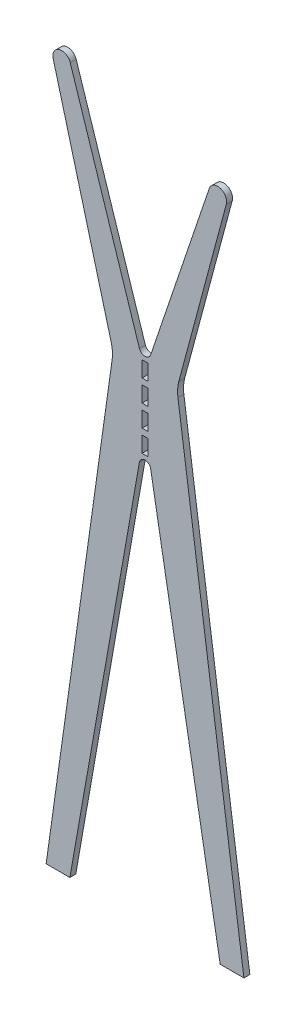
ISO-10303-21;
HEADER;
FILE_DESCRIPTION(('STEP AP214'),'2;1');
FILE_NAME('part.step','',(''),(''),'','','');
FILE_SCHEMA(('AUTOMOTIVE_DESIGN { 1 0 10303 214 1 1 1 1 }'));
ENDSEC;
DATA;
#1=APPLICATION_CONTEXT('core data for automotive mechanical design processes');
#2=APPLICATION_PROTOCOL_DEFINITION('international standard','automotive_design',2000,#1);
#3=PRODUCT_CONTEXT('',#1,'mechanical');
#4=PRODUCT('Part','Part','',(#3));
#5=PRODUCT_RELATED_PRODUCT_CATEGORY('part','',(#4));
#6=PRODUCT_DEFINITION_FORMATION('','',#4);
#7=PRODUCT_DEFINITION_CONTEXT('part definition',#1,'design');
#8=PRODUCT_DEFINITION('design','',#6,#7);
#9=PRODUCT_DEFINITION_SHAPE('','',#8);
#10=(LENGTH_UNIT() NAMED_UNIT(*) SI_UNIT(.MILLI.,.METRE.));
#11=(NAMED_UNIT(*) PLANE_ANGLE_UNIT() SI_UNIT($,.RADIAN.));
#12=(NAMED_UNIT(*) SI_UNIT($,.STERADIAN.) SOLID_ANGLE_UNIT());
#13=UNCERTAINTY_MEASURE_WITH_UNIT(LENGTH_MEASURE(1.E-05),#10,'distance_accuracy_value','');
#14=(GEOMETRIC_REPRESENTATION_CONTEXT(3) GLOBAL_UNCERTAINTY_ASSIGNED_CONTEXT((#13)) GLOBAL_UNIT_ASSIGNED_CONTEXT((#10,
#11,#12)) REPRESENTATION_CONTEXT('',''));
#15=CARTESIAN_POINT('',(0.,0.,0.));
#16=DIRECTION('',(0.,0.,1.));
#17=DIRECTION('',(1.,0.,0.));
#18=AXIS2_PLACEMENT_3D('',#15,#16,#17);
#19=CARTESIAN_POINT('',(172.23547988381,299.999999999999,7.5));
#20=DIRECTION('',(0.,0.,-1.));
#21=DIRECTION('',(-1.,0.,0.));
#22=AXIS2_PLACEMENT_3D('',#19,#20,#21);
#23=PLANE('',#22);
#24=DIRECTION('',(0.,1.,0.));
#25=VECTOR('',#24,1.);
#26=CARTESIAN_POINT('',(7.49999999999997,214.94837345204,7.5));
#27=LINE('',#26,#25);
#28=CARTESIAN_POINT('',(7.49999999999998,174.94837345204,7.5));
#29=VERTEX_POINT('',#28);
#30=CARTESIAN_POINT('',(7.49999999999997,214.94837345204,7.5));
#31=VERTEX_POINT('',#30);
#32=EDGE_CURVE('E300',#29,#31,#27,.T.);
#33=ORIENTED_EDGE('',*,*,#32,.F.);
#34=DIRECTION('',(1.,0.,0.));
#35=VECTOR('',#34,1.);
#36=CARTESIAN_POINT('',(-7.50000000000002,174.94837345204,7.5));
#37=LINE('',#36,#35);
#38=CARTESIAN_POINT('',(-7.50000000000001,174.94837345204,7.5));
#39=VERTEX_POINT('',#38);
#40=EDGE_CURVE('E311',#39,#29,#37,.T.);
#41=ORIENTED_EDGE('',*,*,#40,.F.);
#42=DIRECTION('',(0.,-1.,0.));
#43=VECTOR('',#42,1.);
#44=CARTESIAN_POINT('',(-7.50000000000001,214.94837345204,7.5));
#45=LINE('',#44,#43);
#46=CARTESIAN_POINT('',(-7.50000000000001,214.94837345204,7.5));
#47=VERTEX_POINT('',#46);
#48=EDGE_CURVE('E307',#47,#39,#45,.T.);
#49=ORIENTED_EDGE('',*,*,#48,.F.);
#50=DIRECTION('',(-1.,0.,0.));
#51=VECTOR('',#50,1.);
#52=CARTESIAN_POINT('',(-7.50000000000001,214.94837345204,7.5));
#53=LINE('',#52,#51);
#54=EDGE_CURVE('E303',#31,#47,#53,.T.);
#55=ORIENTED_EDGE('',*,*,#54,.F.);
#56=EDGE_LOOP('',(#33,#41,#49,#55));
#57=FACE_BOUND('',#56,.T.);
#58=DIRECTION('',(0.,1.,0.));
#59=VECTOR('',#58,1.);
#60=CARTESIAN_POINT('',(7.49999999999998,269.94837345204,7.5));
#61=LINE('',#60,#59);
#62=CARTESIAN_POINT('',(7.49999999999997,229.94837345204,7.5));
#63=VERTEX_POINT('',#62);
#64=CARTESIAN_POINT('',(7.49999999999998,269.94837345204,7.5));
#65=VERTEX_POINT('',#64);
#66=EDGE_CURVE('E386',#63,#65,#61,.T.);
#67=ORIENTED_EDGE('',*,*,#66,.F.);
#68=DIRECTION('',(1.,0.,0.));
#69=VECTOR('',#68,1.);
#70=CARTESIAN_POINT('',(-7.50000000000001,229.94837345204,7.5));
#71=LINE('',#70,#69);
#72=CARTESIAN_POINT('',(-7.50000000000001,229.94837345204,7.5));
#73=VERTEX_POINT('',#72);
#74=EDGE_CURVE('E397',#73,#63,#71,.T.);
#75=ORIENTED_EDGE('',*,*,#74,.F.);
#76=DIRECTION('',(0.,-1.,0.));
#77=VECTOR('',#76,1.);
#78=CARTESIAN_POINT('',(-7.50000000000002,269.94837345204,7.5));
#79=LINE('',#78,#77);
#80=CARTESIAN_POINT('',(-7.50000000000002,269.94837345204,7.5));
#81=VERTEX_POINT('',#80);
#82=EDGE_CURVE('E393',#81,#73,#79,.T.);
#83=ORIENTED_EDGE('',*,*,#82,.F.);
#84=DIRECTION('',(-1.,0.,0.));
#85=VECTOR('',#84,1.);
#86=CARTESIAN_POINT('',(-7.50000000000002,269.94837345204,7.5));
#87=LINE('',#86,#85);
#88=EDGE_CURVE('E389',#65,#81,#87,.T.);
#89=ORIENTED_EDGE('',*,*,#88,.F.);
#90=EDGE_LOOP('',(#67,#75,#83,#89));
#91=FACE_BOUND('',#90,.T.);
#92=DIRECTION('',(-0.139173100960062,0.990268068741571,0.));
#93=VECTOR('',#92,1.);
#94=CARTESIAN_POINT('',(250.,-900.,7.5));
#95=LINE('',#94,#93);
#96=CARTESIAN_POINT('',(250.,-900.,7.5));
#97=VERTEX_POINT('',#96);
#98=CARTESIAN_POINT('',(83.1113536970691,287.474420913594,7.5));
#99=VERTEX_POINT('',#98);
#100=EDGE_CURVE('E429',#97,#99,#95,.T.);
#101=ORIENTED_EDGE('',*,*,#100,.T.);
#102=CARTESIAN_POINT('',(172.23547988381,299.999999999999,7.5));
#103=DIRECTION('',(0.,0.,-1.));
#104=DIRECTION('',(-1.,0.,0.));
#105=AXIS2_PLACEMENT_3D('',#102,#103,#104);
#106=CIRCLE('',#105,90.);
#107=CARTESIAN_POINT('',(85.3021555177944,323.293714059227,7.5));
#108=VERTEX_POINT('',#107);
#109=EDGE_CURVE('E433',#99,#108,#106,.T.);
#110=ORIENTED_EDGE('',*,*,#109,.T.);
#111=DIRECTION('',(0.258819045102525,0.965925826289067,0.));
#112=VECTOR('',#111,1.);
#113=CARTESIAN_POINT('',(85.3021555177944,323.293714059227,7.5));
#114=LINE('',#113,#112);
#115=CARTESIAN_POINT('',(205.442086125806,771.662039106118,7.5));
#116=VERTEX_POINT('',#115);
#117=EDGE_CURVE('E437',#108,#116,#114,.T.);
#118=ORIENTED_EDGE('',*,*,#117,.T.);
#119=CARTESIAN_POINT('',(183.697603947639,777.488455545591,7.5));
#120=DIRECTION('',(0.,0.,1.));
#121=DIRECTION('',(-1.,0.,0.));
#122=AXIS2_PLACEMENT_3D('',#119,#120,#121);
#123=CIRCLE('',#122,22.5115444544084);
#124=CARTESIAN_POINT('',(162.370665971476,784.69479652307,7.5));
#125=VERTEX_POINT('',#124);
#126=EDGE_CURVE('E440',#116,#125,#123,.T.);
#127=ORIENTED_EDGE('',*,*,#126,.T.);
#128=DIRECTION('',(-0.320117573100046,-0.947377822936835,0.));
#129=VECTOR('',#128,1.);
#130=CARTESIAN_POINT('',(14.2106673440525,346.219971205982,7.5));
#131=LINE('',#130,#129);
#132=CARTESIAN_POINT('',(14.2106673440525,346.219971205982,7.5));
#133=VERTEX_POINT('',#132);
#134=EDGE_CURVE('E443',#125,#133,#131,.T.);
#135=ORIENTED_EDGE('',*,*,#134,.T.);
#136=CARTESIAN_POINT('',(0.,351.021734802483,7.5));
#137=DIRECTION('',(0.,0.,-1.));
#138=DIRECTION('',(1.,0.,0.));
#139=AXIS2_PLACEMENT_3D('',#136,#137,#138);
#140=CIRCLE('',#139,15.);
#141=CARTESIAN_POINT('',(-14.2106673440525,346.219971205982,7.5));
#142=VERTEX_POINT('',#141);
#143=EDGE_CURVE('E446',#133,#142,#140,.T.);
#144=ORIENTED_EDGE('',*,*,#143,.T.);
#145=DIRECTION('',(-0.309016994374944,0.951056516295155,0.));
#146=VECTOR('',#145,1.);
#147=CARTESIAN_POINT('',(-189.091409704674,884.447552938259,7.5));
#148=LINE('',#147,#146);
#149=CARTESIAN_POINT('',(-189.091409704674,884.447552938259,7.5));
#150=VERTEX_POINT('',#149);
#151=EDGE_CURVE('E449',#142,#150,#148,.T.);
#152=ORIENTED_EDGE('',*,*,#151,.T.);
#153=CARTESIAN_POINT('',(-210.497516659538,877.492287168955,7.5));
#154=DIRECTION('',(0.,0.,1.));
#155=DIRECTION('',(-1.,0.,0.));
#156=AXIS2_PLACEMENT_3D('',#153,#154,#155);
#157=CIRCLE('',#156,22.5077128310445);
#158=CARTESIAN_POINT('',(-232.238297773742,871.666862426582,7.5));
#159=VERTEX_POINT('',#158);
#160=EDGE_CURVE('E452',#150,#159,#157,.T.);
#161=ORIENTED_EDGE('',*,*,#160,.T.);
#162=DIRECTION('',(0.258819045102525,-0.965925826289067,0.));
#163=VECTOR('',#162,1.);
#164=CARTESIAN_POINT('',(-85.3021555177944,323.293714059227,7.5));
#165=LINE('',#164,#163);
#166=CARTESIAN_POINT('',(-85.3021555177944,323.293714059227,7.5));
#167=VERTEX_POINT('',#166);
#168=EDGE_CURVE('E455',#159,#167,#165,.T.);
#169=ORIENTED_EDGE('',*,*,#168,.T.);
#170=CARTESIAN_POINT('',(-172.23547988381,299.999999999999,7.5));
#171=DIRECTION('',(0.,0.,-1.));
#172=DIRECTION('',(1.,0.,0.));
#173=AXIS2_PLACEMENT_3D('',#170,#171,#172);
#174=CIRCLE('',#173,90.);
#175=CARTESIAN_POINT('',(-83.1113536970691,287.474420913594,7.5));
#176=VERTEX_POINT('',#175);
#177=EDGE_CURVE('E458',#167,#176,#174,.T.);
#178=ORIENTED_EDGE('',*,*,#177,.T.);
#179=DIRECTION('',(-0.139173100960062,-0.990268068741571,0.));
#180=VECTOR('',#179,1.);
#181=CARTESIAN_POINT('',(-250.,-900.,7.5));
#182=LINE('',#181,#180);
#183=CARTESIAN_POINT('',(-250.,-900.,7.5));
#184=VERTEX_POINT('',#183);
#185=EDGE_CURVE('E461',#176,#184,#182,.T.);
#186=ORIENTED_EDGE('',*,*,#185,.T.);
#187=DIRECTION('',(1.,0.,0.));
#188=VECTOR('',#187,1.);
#189=CARTESIAN_POINT('',(-250.,-900.,7.5));
#190=LINE('',#189,#188);
#191=CARTESIAN_POINT('',(-190.,-900.,7.5));
#192=VERTEX_POINT('',#191);
#193=EDGE_CURVE('E464',#184,#192,#190,.T.);
#194=ORIENTED_EDGE('',*,*,#193,.T.);
#195=DIRECTION('',(0.173648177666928,0.984807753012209,0.));
#196=VECTOR('',#195,1.);
#197=CARTESIAN_POINT('',(-190.,-900.,7.5));
#198=LINE('',#197,#196);
#199=CARTESIAN_POINT('',(-14.2106673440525,96.9508463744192,7.5));
#200=VERTEX_POINT('',#199);
#201=EDGE_CURVE('E467',#192,#200,#198,.T.);
#202=ORIENTED_EDGE('',*,*,#201,.T.);
#203=CARTESIAN_POINT('',(0.,94.4451223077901,7.5));
#204=DIRECTION('',(0.,0.,-1.));
#205=DIRECTION('',(-1.,0.,0.));
#206=AXIS2_PLACEMENT_3D('',#203,#204,#205);
#207=CIRCLE('',#206,14.4298897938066);
#208=CARTESIAN_POINT('',(14.2106673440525,96.9508463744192,7.5));
#209=VERTEX_POINT('',#208);
#210=EDGE_CURVE('E470',#200,#209,#207,.T.);
#211=ORIENTED_EDGE('',*,*,#210,.T.);
#212=DIRECTION('',(0.173648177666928,-0.984807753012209,0.));
#213=VECTOR('',#212,1.);
#214=CARTESIAN_POINT('',(190.,-900.,7.5));
#215=LINE('',#214,#213);
#216=CARTESIAN_POINT('',(190.,-900.,7.5));
#217=VERTEX_POINT('',#216);
#218=EDGE_CURVE('E473',#209,#217,#215,.T.);
#219=ORIENTED_EDGE('',*,*,#218,.T.);
#220=DIRECTION('',(1.,0.,0.));
#221=VECTOR('',#220,1.);
#222=CARTESIAN_POINT('',(250.,-900.,7.5));
#223=LINE('',#222,#221);
#224=EDGE_CURVE('E476',#217,#97,#223,.T.);
#225=ORIENTED_EDGE('',*,*,#224,.T.);
#226=EDGE_LOOP('',(#101,#110,#118,#127,#135,#144,#152,#161,#169,#178,#186,#194,#202,#211,#219,#225));
#227=FACE_BOUND('',#226,.T.);
#228=DIRECTION('',(0.,1.,0.));
#229=VECTOR('',#228,1.);
#230=CARTESIAN_POINT('',(7.49999999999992,324.94837345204,7.5));
#231=LINE('',#230,#229);
#232=CARTESIAN_POINT('',(7.49999999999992,284.94837345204,7.5));
#233=VERTEX_POINT('',#232);
#234=CARTESIAN_POINT('',(7.49999999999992,324.94837345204,7.5));
#235=VERTEX_POINT('',#234);
#236=EDGE_CURVE('E343',#233,#235,#231,.T.);
#237=ORIENTED_EDGE('',*,*,#236,.F.);
#238=DIRECTION('',(1.,0.,0.));
#239=VECTOR('',#238,1.);
#240=CARTESIAN_POINT('',(-7.50000000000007,284.94837345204,7.5));
#241=LINE('',#240,#239);
#242=CARTESIAN_POINT('',(-7.50000000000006,284.94837345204,7.5));
#243=VERTEX_POINT('',#242);
#244=EDGE_CURVE('E354',#243,#233,#241,.T.);
#245=ORIENTED_EDGE('',*,*,#244,.F.);
#246=DIRECTION('',(0.,-1.,0.));
#247=VECTOR('',#246,1.);
#248=CARTESIAN_POINT('',(-7.50000000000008,324.94837345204,7.5));
#249=LINE('',#248,#247);
#250=CARTESIAN_POINT('',(-7.50000000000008,324.94837345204,7.5));
#251=VERTEX_POINT('',#250);
#252=EDGE_CURVE('E350',#251,#243,#249,.T.);
#253=ORIENTED_EDGE('',*,*,#252,.F.);
#254=DIRECTION('',(-1.,0.,0.));
#255=VECTOR('',#254,1.);
#256=CARTESIAN_POINT('',(-7.50000000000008,324.94837345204,7.5));
#257=LINE('',#256,#255);
#258=EDGE_CURVE('E346',#235,#251,#257,.T.);
#259=ORIENTED_EDGE('',*,*,#258,.F.);
#260=EDGE_LOOP('',(#237,#245,#253,#259));
#261=FACE_BOUND('',#260,.T.);
#262=DIRECTION('',(0.,1.,0.));
#263=VECTOR('',#262,1.);
#264=CARTESIAN_POINT('',(7.49999999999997,159.94837345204,7.5));
#265=LINE('',#264,#263);
#266=CARTESIAN_POINT('',(7.49999999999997,119.94837345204,7.5));
#267=VERTEX_POINT('',#266);
#268=CARTESIAN_POINT('',(7.49999999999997,159.94837345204,7.5));
#269=VERTEX_POINT('',#268);
#270=EDGE_CURVE('E252',#267,#269,#265,.T.);
#271=ORIENTED_EDGE('',*,*,#270,.F.);
#272=DIRECTION('',(1.,0.,0.));
#273=VECTOR('',#272,1.);
#274=CARTESIAN_POINT('',(-7.50000000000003,119.94837345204,7.5));
#275=LINE('',#274,#273);
#276=CARTESIAN_POINT('',(-7.50000000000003,119.94837345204,7.5));
#277=VERTEX_POINT('',#276);
#278=EDGE_CURVE('E278',#277,#267,#275,.T.);
#279=ORIENTED_EDGE('',*,*,#278,.F.);
#280=DIRECTION('',(0.,-1.,0.));
#281=VECTOR('',#280,1.);
#282=CARTESIAN_POINT('',(-7.50000000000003,159.94837345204,7.5));
#283=LINE('',#282,#281);
#284=CARTESIAN_POINT('',(-7.50000000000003,159.94837345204,7.5));
#285=VERTEX_POINT('',#284);
#286=EDGE_CURVE('E274',#285,#277,#283,.T.);
#287=ORIENTED_EDGE('',*,*,#286,.F.);
#288=DIRECTION('',(-1.,0.,0.));
#289=VECTOR('',#288,1.);
#290=CARTESIAN_POINT('',(-7.50000000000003,159.94837345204,7.5));
#291=LINE('',#290,#289);
#292=EDGE_CURVE('E261',#269,#285,#291,.T.);
#293=ORIENTED_EDGE('',*,*,#292,.F.);
#294=EDGE_LOOP('',(#271,#279,#287,#293));
#295=FACE_BOUND('',#294,.T.);
#296=ADVANCED_FACE('F42',(#57,#91,#227,#261,#295),#23,.F.);
#297=CARTESIAN_POINT('',(172.23547988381,299.999999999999,-7.5));
#298=DIRECTION('',(0.,0.,-1.));
#299=DIRECTION('',(-1.,0.,0.));
#300=AXIS2_PLACEMENT_3D('',#297,#298,#299);
#301=PLANE('',#300);
#302=DIRECTION('',(-0.139173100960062,0.990268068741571,0.));
#303=VECTOR('',#302,1.);
#304=CARTESIAN_POINT('',(250.,-900.,-7.5));
#305=LINE('',#304,#303);
#306=CARTESIAN_POINT('',(250.,-900.,-7.5));
#307=VERTEX_POINT('',#306);
#308=CARTESIAN_POINT('',(83.1113536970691,287.474420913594,-7.5));
#309=VERTEX_POINT('',#308);
#310=EDGE_CURVE('E428',#307,#309,#305,.T.);
#311=ORIENTED_EDGE('',*,*,#310,.F.);
#312=DIRECTION('',(1.,0.,0.));
#313=VECTOR('',#312,1.);
#314=CARTESIAN_POINT('',(250.,-900.,-7.5));
#315=LINE('',#314,#313);
#316=CARTESIAN_POINT('',(190.,-900.,-7.5));
#317=VERTEX_POINT('',#316);
#318=EDGE_CURVE('E434',#317,#307,#315,.T.);
#319=ORIENTED_EDGE('',*,*,#318,.F.);
#320=DIRECTION('',(0.173648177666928,-0.984807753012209,0.));
#321=VECTOR('',#320,1.);
#322=CARTESIAN_POINT('',(190.,-900.,-7.5));
#323=LINE('',#322,#321);
#324=CARTESIAN_POINT('',(14.2106673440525,96.9508463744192,-7.5));
#325=VERTEX_POINT('',#324);
#326=EDGE_CURVE('E522',#325,#317,#323,.T.);
#327=ORIENTED_EDGE('',*,*,#326,.F.);
#328=CARTESIAN_POINT('',(0.,94.4451223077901,-7.5));
#329=DIRECTION('',(0.,0.,-1.));
#330=DIRECTION('',(-1.,0.,0.));
#331=AXIS2_PLACEMENT_3D('',#328,#329,#330);
#332=CIRCLE('',#331,14.4298897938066);
#333=CARTESIAN_POINT('',(-14.2106673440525,96.9508463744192,-7.5));
#334=VERTEX_POINT('',#333);
#335=EDGE_CURVE('E519',#334,#325,#332,.T.);
#336=ORIENTED_EDGE('',*,*,#335,.F.);
#337=DIRECTION('',(0.173648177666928,0.984807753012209,0.));
#338=VECTOR('',#337,1.);
#339=CARTESIAN_POINT('',(-190.,-900.,-7.5));
#340=LINE('',#339,#338);
#341=CARTESIAN_POINT('',(-190.,-900.,-7.5));
#342=VERTEX_POINT('',#341);
#343=EDGE_CURVE('E516',#342,#334,#340,.T.);
#344=ORIENTED_EDGE('',*,*,#343,.F.);
#345=DIRECTION('',(1.,0.,0.));
#346=VECTOR('',#345,1.);
#347=CARTESIAN_POINT('',(-250.,-900.,-7.5));
#348=LINE('',#347,#346);
#349=CARTESIAN_POINT('',(-250.,-900.,-7.5));
#350=VERTEX_POINT('',#349);
#351=EDGE_CURVE('E513',#350,#342,#348,.T.);
#352=ORIENTED_EDGE('',*,*,#351,.F.);
#353=DIRECTION('',(-0.139173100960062,-0.990268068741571,0.));
#354=VECTOR('',#353,1.);
#355=CARTESIAN_POINT('',(-250.,-900.,-7.5));
#356=LINE('',#355,#354);
#357=CARTESIAN_POINT('',(-83.1113536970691,287.474420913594,-7.5));
#358=VERTEX_POINT('',#357);
#359=EDGE_CURVE('E510',#358,#350,#356,.T.);
#360=ORIENTED_EDGE('',*,*,#359,.F.);
#361=CARTESIAN_POINT('',(-172.23547988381,299.999999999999,-7.5));
#362=DIRECTION('',(0.,0.,-1.));
#363=DIRECTION('',(1.,0.,0.));
#364=AXIS2_PLACEMENT_3D('',#361,#362,#363);
#365=CIRCLE('',#364,90.);
#366=CARTESIAN_POINT('',(-85.3021555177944,323.293714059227,-7.5));
#367=VERTEX_POINT('',#366);
#368=EDGE_CURVE('E507',#367,#358,#365,.T.);
#369=ORIENTED_EDGE('',*,*,#368,.F.);
#370=DIRECTION('',(0.258819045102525,-0.965925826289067,0.));
#371=VECTOR('',#370,1.);
#372=CARTESIAN_POINT('',(-85.3021555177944,323.293714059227,-7.5));
#373=LINE('',#372,#371);
#374=CARTESIAN_POINT('',(-232.238297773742,871.666862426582,-7.5));
#375=VERTEX_POINT('',#374);
#376=EDGE_CURVE('E504',#375,#367,#373,.T.);
#377=ORIENTED_EDGE('',*,*,#376,.F.);
#378=CARTESIAN_POINT('',(-210.497516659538,877.492287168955,-7.5));
#379=DIRECTION('',(0.,0.,1.));
#380=DIRECTION('',(-1.,0.,0.));
#381=AXIS2_PLACEMENT_3D('',#378,#379,#380);
#382=CIRCLE('',#381,22.5077128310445);
#383=CARTESIAN_POINT('',(-189.091409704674,884.447552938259,-7.5));
#384=VERTEX_POINT('',#383);
#385=EDGE_CURVE('E501',#384,#375,#382,.T.);
#386=ORIENTED_EDGE('',*,*,#385,.F.);
#387=DIRECTION('',(-0.309016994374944,0.951056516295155,0.));
#388=VECTOR('',#387,1.);
#389=CARTESIAN_POINT('',(-189.091409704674,884.447552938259,-7.5));
#390=LINE('',#389,#388);
#391=CARTESIAN_POINT('',(-14.2106673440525,346.219971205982,-7.5));
#392=VERTEX_POINT('',#391);
#393=EDGE_CURVE('E498',#392,#384,#390,.T.);
#394=ORIENTED_EDGE('',*,*,#393,.F.);
#395=CARTESIAN_POINT('',(0.,351.021734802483,-7.5));
#396=DIRECTION('',(0.,0.,-1.));
#397=DIRECTION('',(1.,0.,0.));
#398=AXIS2_PLACEMENT_3D('',#395,#396,#397);
#399=CIRCLE('',#398,15.);
#400=CARTESIAN_POINT('',(14.2106673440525,346.219971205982,-7.5));
#401=VERTEX_POINT('',#400);
#402=EDGE_CURVE('E495',#401,#392,#399,.T.);
#403=ORIENTED_EDGE('',*,*,#402,.F.);
#404=DIRECTION('',(-0.320117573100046,-0.947377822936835,0.));
#405=VECTOR('',#404,1.);
#406=CARTESIAN_POINT('',(14.2106673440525,346.219971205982,-7.5));
#407=LINE('',#406,#405);
#408=CARTESIAN_POINT('',(162.370665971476,784.69479652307,-7.5));
#409=VERTEX_POINT('',#408);
#410=EDGE_CURVE('E492',#409,#401,#407,.T.);
#411=ORIENTED_EDGE('',*,*,#410,.F.);
#412=CARTESIAN_POINT('',(183.697603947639,777.488455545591,-7.5));
#413=DIRECTION('',(0.,0.,1.));
#414=DIRECTION('',(-1.,0.,0.));
#415=AXIS2_PLACEMENT_3D('',#412,#413,#414);
#416=CIRCLE('',#415,22.5115444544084);
#417=CARTESIAN_POINT('',(205.442086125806,771.662039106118,-7.5));
#418=VERTEX_POINT('',#417);
#419=EDGE_CURVE('E489',#418,#409,#416,.T.);
#420=ORIENTED_EDGE('',*,*,#419,.F.);
#421=DIRECTION('',(0.258819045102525,0.965925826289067,0.));
#422=VECTOR('',#421,1.);
#423=CARTESIAN_POINT('',(85.3021555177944,323.293714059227,-7.5));
#424=LINE('',#423,#422);
#425=CARTESIAN_POINT('',(85.3021555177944,323.293714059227,-7.5));
#426=VERTEX_POINT('',#425);
#427=EDGE_CURVE('E486',#426,#418,#424,.T.);
#428=ORIENTED_EDGE('',*,*,#427,.F.);
#429=CARTESIAN_POINT('',(172.23547988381,299.999999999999,-7.5));
#430=DIRECTION('',(0.,0.,-1.));
#431=DIRECTION('',(-1.,0.,0.));
#432=AXIS2_PLACEMENT_3D('',#429,#430,#431);
#433=CIRCLE('',#432,90.);
#434=EDGE_CURVE('E483',#309,#426,#433,.T.);
#435=ORIENTED_EDGE('',*,*,#434,.F.);
#436=EDGE_LOOP('',(#311,#319,#327,#336,#344,#352,#360,#369,#377,#386,#394,#403,#411,#420,#428,#435));
#437=FACE_BOUND('',#436,.T.);
#438=DIRECTION('',(1.,0.,0.));
#439=VECTOR('',#438,1.);
#440=CARTESIAN_POINT('',(-7.50000000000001,229.94837345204,-7.5));
#441=LINE('',#440,#439);
#442=CARTESIAN_POINT('',(-7.50000000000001,229.94837345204,-7.5));
#443=VERTEX_POINT('',#442);
#444=CARTESIAN_POINT('',(7.49999999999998,229.94837345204,-7.5));
#445=VERTEX_POINT('',#444);
#446=EDGE_CURVE('E390',#443,#445,#441,.T.);
#447=ORIENTED_EDGE('',*,*,#446,.T.);
#448=DIRECTION('',(0.,1.,0.));
#449=VECTOR('',#448,1.);
#450=CARTESIAN_POINT('',(7.49999999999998,269.94837345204,-7.5));
#451=LINE('',#450,#449);
#452=CARTESIAN_POINT('',(7.49999999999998,269.94837345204,-7.5));
#453=VERTEX_POINT('',#452);
#454=EDGE_CURVE('E385',#445,#453,#451,.T.);
#455=ORIENTED_EDGE('',*,*,#454,.T.);
#456=DIRECTION('',(-1.,0.,0.));
#457=VECTOR('',#456,1.);
#458=CARTESIAN_POINT('',(-7.50000000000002,269.94837345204,-7.5));
#459=LINE('',#458,#457);
#460=CARTESIAN_POINT('',(-7.50000000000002,269.94837345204,-7.5));
#461=VERTEX_POINT('',#460);
#462=EDGE_CURVE('E404',#453,#461,#459,.T.);
#463=ORIENTED_EDGE('',*,*,#462,.T.);
#464=DIRECTION('',(0.,-1.,0.));
#465=VECTOR('',#464,1.);
#466=CARTESIAN_POINT('',(-7.50000000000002,269.94837345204,-7.5));
#467=LINE('',#466,#465);
#468=EDGE_CURVE('E408',#461,#443,#467,.T.);
#469=ORIENTED_EDGE('',*,*,#468,.T.);
#470=EDGE_LOOP('',(#447,#455,#463,#469));
#471=FACE_BOUND('',#470,.T.);
#472=DIRECTION('',(1.,0.,0.));
#473=VECTOR('',#472,1.);
#474=CARTESIAN_POINT('',(-7.50000000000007,284.94837345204,-7.5));
#475=LINE('',#474,#473);
#476=CARTESIAN_POINT('',(-7.50000000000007,284.94837345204,-7.5));
#477=VERTEX_POINT('',#476);
#478=CARTESIAN_POINT('',(7.49999999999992,284.94837345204,-7.5));
#479=VERTEX_POINT('',#478);
#480=EDGE_CURVE('E347',#477,#479,#475,.T.);
#481=ORIENTED_EDGE('',*,*,#480,.T.);
#482=DIRECTION('',(0.,1.,0.));
#483=VECTOR('',#482,1.);
#484=CARTESIAN_POINT('',(7.49999999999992,324.94837345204,-7.5));
#485=LINE('',#484,#483);
#486=CARTESIAN_POINT('',(7.49999999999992,324.94837345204,-7.5));
#487=VERTEX_POINT('',#486);
#488=EDGE_CURVE('E342',#479,#487,#485,.T.);
#489=ORIENTED_EDGE('',*,*,#488,.T.);
#490=DIRECTION('',(-1.,0.,0.));
#491=VECTOR('',#490,1.);
#492=CARTESIAN_POINT('',(-7.50000000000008,324.94837345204,-7.5));
#493=LINE('',#492,#491);
#494=CARTESIAN_POINT('',(-7.50000000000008,324.94837345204,-7.5));
#495=VERTEX_POINT('',#494);
#496=EDGE_CURVE('E361',#487,#495,#493,.T.);
#497=ORIENTED_EDGE('',*,*,#496,.T.);
#498=DIRECTION('',(0.,-1.,0.));
#499=VECTOR('',#498,1.);
#500=CARTESIAN_POINT('',(-7.50000000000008,324.94837345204,-7.5));
#501=LINE('',#500,#499);
#502=EDGE_CURVE('E365',#495,#477,#501,.T.);
#503=ORIENTED_EDGE('',*,*,#502,.T.);
#504=EDGE_LOOP('',(#481,#489,#497,#503));
#505=FACE_BOUND('',#504,.T.);
#506=DIRECTION('',(1.,0.,0.));
#507=VECTOR('',#506,1.);
#508=CARTESIAN_POINT('',(-7.50000000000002,174.94837345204,-7.5));
#509=LINE('',#508,#507);
#510=CARTESIAN_POINT('',(-7.50000000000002,174.94837345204,-7.5));
#511=VERTEX_POINT('',#510);
#512=CARTESIAN_POINT('',(7.49999999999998,174.94837345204,-7.5));
#513=VERTEX_POINT('',#512);
#514=EDGE_CURVE('E304',#511,#513,#509,.T.);
#515=ORIENTED_EDGE('',*,*,#514,.T.);
#516=DIRECTION('',(0.,1.,0.));
#517=VECTOR('',#516,1.);
#518=CARTESIAN_POINT('',(7.49999999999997,214.94837345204,-7.5));
#519=LINE('',#518,#517);
#520=CARTESIAN_POINT('',(7.49999999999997,214.94837345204,-7.5));
#521=VERTEX_POINT('',#520);
#522=EDGE_CURVE('E270',#513,#521,#519,.T.);
#523=ORIENTED_EDGE('',*,*,#522,.T.);
#524=DIRECTION('',(-1.,0.,0.));
#525=VECTOR('',#524,1.);
#526=CARTESIAN_POINT('',(-7.50000000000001,214.94837345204,-7.5));
#527=LINE('',#526,#525);
#528=CARTESIAN_POINT('',(-7.50000000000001,214.94837345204,-7.5));
#529=VERTEX_POINT('',#528);
#530=EDGE_CURVE('E318',#521,#529,#527,.T.);
#531=ORIENTED_EDGE('',*,*,#530,.T.);
#532=DIRECTION('',(0.,-1.,0.));
#533=VECTOR('',#532,1.);
#534=CARTESIAN_POINT('',(-7.50000000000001,214.94837345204,-7.5));
#535=LINE('',#534,#533);
#536=EDGE_CURVE('E322',#529,#511,#535,.T.);
#537=ORIENTED_EDGE('',*,*,#536,.T.);
#538=EDGE_LOOP('',(#515,#523,#531,#537));
#539=FACE_BOUND('',#538,.T.);
#540=DIRECTION('',(1.,0.,0.));
#541=VECTOR('',#540,1.);
#542=CARTESIAN_POINT('',(-7.50000000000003,119.94837345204,-7.5));
#543=LINE('',#542,#541);
#544=CARTESIAN_POINT('',(-7.50000000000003,119.94837345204,-7.5));
#545=VERTEX_POINT('',#544);
#546=CARTESIAN_POINT('',(7.49999999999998,119.94837345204,-7.5));
#547=VERTEX_POINT('',#546);
#548=EDGE_CURVE('E262',#545,#547,#543,.T.);
#549=ORIENTED_EDGE('',*,*,#548,.T.);
#550=DIRECTION('',(0.,1.,0.));
#551=VECTOR('',#550,1.);
#552=CARTESIAN_POINT('',(7.49999999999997,159.94837345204,-7.5));
#553=LINE('',#552,#551);
#554=CARTESIAN_POINT('',(7.49999999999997,159.94837345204,-7.5));
#555=VERTEX_POINT('',#554);
#556=EDGE_CURVE('E66',#547,#555,#553,.T.);
#557=ORIENTED_EDGE('',*,*,#556,.T.);
#558=DIRECTION('',(-1.,0.,0.));
#559=VECTOR('',#558,1.);
#560=CARTESIAN_POINT('',(-7.50000000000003,159.94837345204,-7.5));
#561=LINE('',#560,#559);
#562=CARTESIAN_POINT('',(-7.50000000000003,159.94837345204,-7.5));
#563=VERTEX_POINT('',#562);
#564=EDGE_CURVE('E268',#555,#563,#561,.T.);
#565=ORIENTED_EDGE('',*,*,#564,.T.);
#566=DIRECTION('',(0.,-1.,0.));
#567=VECTOR('',#566,1.);
#568=CARTESIAN_POINT('',(-7.50000000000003,159.94837345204,-7.5));
#569=LINE('',#568,#567);
#570=EDGE_CURVE('E287',#563,#545,#569,.T.);
#571=ORIENTED_EDGE('',*,*,#570,.T.);
#572=EDGE_LOOP('',(#549,#557,#565,#571));
#573=FACE_BOUND('',#572,.T.);
#574=ADVANCED_FACE('F593',(#437,#471,#505,#539,#573),#301,.T.);
#575=CARTESIAN_POINT('',(250.,-900.,7.5));
#576=DIRECTION('',(-0.990268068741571,-0.139173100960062,0.));
#577=DIRECTION('',(0.139173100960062,-0.990268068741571,0.));
#578=AXIS2_PLACEMENT_3D('',#575,#576,#577);
#579=PLANE('',#578);
#580=ORIENTED_EDGE('',*,*,#310,.T.);
#581=DIRECTION('',(0.,0.,-1.));
#582=VECTOR('',#581,1.);
#583=CARTESIAN_POINT('',(83.1113536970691,287.474420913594,7.5));
#584=LINE('',#583,#582);
#585=EDGE_CURVE('E11',#99,#309,#584,.T.);
#586=ORIENTED_EDGE('',*,*,#585,.F.);
#587=ORIENTED_EDGE('',*,*,#100,.F.);
#588=DIRECTION('',(0.,0.,-1.));
#589=VECTOR('',#588,1.);
#590=CARTESIAN_POINT('',(250.,-900.,7.5));
#591=LINE('',#590,#589);
#592=EDGE_CURVE('E479',#97,#307,#591,.T.);
#593=ORIENTED_EDGE('',*,*,#592,.T.);
#594=EDGE_LOOP('',(#580,#586,#587,#593));
#595=FACE_BOUND('',#594,.T.);
#596=ADVANCED_FACE('F44',(#595),#579,.F.);
#597=CARTESIAN_POINT('',(172.23547988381,299.999999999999,7.5));
#598=DIRECTION('',(0.,0.,-1.));
#599=DIRECTION('',(-1.,0.,0.));
#600=AXIS2_PLACEMENT_3D('',#597,#598,#599);
#601=CYLINDRICAL_SURFACE('',#600,90.);
#602=ORIENTED_EDGE('',*,*,#434,.T.);
#603=DIRECTION('',(0.,0.,-1.));
#604=VECTOR('',#603,1.);
#605=CARTESIAN_POINT('',(85.3021555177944,323.293714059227,7.5));
#606=LINE('',#605,#604);
#607=EDGE_CURVE('E51',#108,#426,#606,.T.);
#608=ORIENTED_EDGE('',*,*,#607,.F.);
#609=ORIENTED_EDGE('',*,*,#109,.F.);
#610=ORIENTED_EDGE('',*,*,#585,.T.);
#611=EDGE_LOOP('',(#602,#608,#609,#610));
#612=FACE_BOUND('',#611,.T.);
#613=ADVANCED_FACE('F611',(#612),#601,.F.);
#614=CARTESIAN_POINT('',(85.3021555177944,323.293714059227,7.5));
#615=DIRECTION('',(-0.965925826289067,0.258819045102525,0.));
#616=DIRECTION('',(-0.258819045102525,-0.965925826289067,0.));
#617=AXIS2_PLACEMENT_3D('',#614,#615,#616);
#618=PLANE('',#617);
#619=ORIENTED_EDGE('',*,*,#427,.T.);
#620=DIRECTION('',(0.,0.,-1.));
#621=VECTOR('',#620,1.);
#622=CARTESIAN_POINT('',(205.442086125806,771.662039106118,7.5));
#623=LINE('',#622,#621);
#624=EDGE_CURVE('E578',#116,#418,#623,.T.);
#625=ORIENTED_EDGE('',*,*,#624,.F.);
#626=ORIENTED_EDGE('',*,*,#117,.F.);
#627=ORIENTED_EDGE('',*,*,#607,.T.);
#628=EDGE_LOOP('',(#619,#625,#626,#627));
#629=FACE_BOUND('',#628,.T.);
#630=ADVANCED_FACE('F587',(#629),#618,.F.);
#631=CARTESIAN_POINT('',(183.697603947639,777.488455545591,7.5));
#632=DIRECTION('',(0.,0.,-1.));
#633=DIRECTION('',(-1.,0.,0.));
#634=AXIS2_PLACEMENT_3D('',#631,#632,#633);
#635=CYLINDRICAL_SURFACE('',#634,22.5115444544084);
#636=ORIENTED_EDGE('',*,*,#419,.T.);
#637=DIRECTION('',(0.,0.,-1.));
#638=VECTOR('',#637,1.);
#639=CARTESIAN_POINT('',(162.370665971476,784.69479652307,7.5));
#640=LINE('',#639,#638);
#641=EDGE_CURVE('E574',#125,#409,#640,.T.);
#642=ORIENTED_EDGE('',*,*,#641,.F.);
#643=ORIENTED_EDGE('',*,*,#126,.F.);
#644=ORIENTED_EDGE('',*,*,#624,.T.);
#645=EDGE_LOOP('',(#636,#642,#643,#644));
#646=FACE_BOUND('',#645,.T.);
#647=ADVANCED_FACE('F599',(#646),#635,.T.);
#648=CARTESIAN_POINT('',(14.2106673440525,346.219971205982,7.5));
#649=DIRECTION('',(0.947377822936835,-0.320117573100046,0.));
#650=DIRECTION('',(0.320117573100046,0.947377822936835,0.));
#651=AXIS2_PLACEMENT_3D('',#648,#649,#650);
#652=PLANE('',#651);
#653=ORIENTED_EDGE('',*,*,#410,.T.);
#654=DIRECTION('',(0.,0.,-1.));
#655=VECTOR('',#654,1.);
#656=CARTESIAN_POINT('',(14.2106673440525,346.219971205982,7.5));
#657=LINE('',#656,#655);
#658=EDGE_CURVE('E570',#133,#401,#657,.T.);
#659=ORIENTED_EDGE('',*,*,#658,.F.);
#660=ORIENTED_EDGE('',*,*,#134,.F.);
#661=ORIENTED_EDGE('',*,*,#641,.T.);
#662=EDGE_LOOP('',(#653,#659,#660,#661));
#663=FACE_BOUND('',#662,.T.);
#664=ADVANCED_FACE('F603',(#663),#652,.F.);
#665=CARTESIAN_POINT('',(0.,351.021734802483,7.5));
#666=DIRECTION('',(0.,0.,-1.));
#667=DIRECTION('',(-1.,0.,0.));
#668=AXIS2_PLACEMENT_3D('',#665,#666,#667);
#669=CYLINDRICAL_SURFACE('',#668,15.);
#670=ORIENTED_EDGE('',*,*,#402,.T.);
#671=DIRECTION('',(0.,0.,-1.));
#672=VECTOR('',#671,1.);
#673=CARTESIAN_POINT('',(-14.2106673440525,346.219971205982,7.5));
#674=LINE('',#673,#672);
#675=EDGE_CURVE('E566',#142,#392,#674,.T.);
#676=ORIENTED_EDGE('',*,*,#675,.F.);
#677=ORIENTED_EDGE('',*,*,#143,.F.);
#678=ORIENTED_EDGE('',*,*,#658,.T.);
#679=EDGE_LOOP('',(#670,#676,#677,#678));
#680=FACE_BOUND('',#679,.T.);
#681=ADVANCED_FACE('F664',(#680),#669,.F.);
#682=CARTESIAN_POINT('',(-189.091409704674,884.447552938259,7.5));
#683=DIRECTION('',(-0.951056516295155,-0.309016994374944,0.));
#684=DIRECTION('',(0.309016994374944,-0.951056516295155,0.));
#685=AXIS2_PLACEMENT_3D('',#682,#683,#684);
#686=PLANE('',#685);
#687=ORIENTED_EDGE('',*,*,#393,.T.);
#688=DIRECTION('',(0.,0.,-1.));
#689=VECTOR('',#688,1.);
#690=CARTESIAN_POINT('',(-189.091409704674,884.447552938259,7.5));
#691=LINE('',#690,#689);
#692=EDGE_CURVE('E562',#150,#384,#691,.T.);
#693=ORIENTED_EDGE('',*,*,#692,.F.);
#694=ORIENTED_EDGE('',*,*,#151,.F.);
#695=ORIENTED_EDGE('',*,*,#675,.T.);
#696=EDGE_LOOP('',(#687,#693,#694,#695));
#697=FACE_BOUND('',#696,.T.);
#698=ADVANCED_FACE('F661',(#697),#686,.F.);
#699=CARTESIAN_POINT('',(-210.497516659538,877.492287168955,7.5));
#700=DIRECTION('',(0.,0.,-1.));
#701=DIRECTION('',(-1.,0.,0.));
#702=AXIS2_PLACEMENT_3D('',#699,#700,#701);
#703=CYLINDRICAL_SURFACE('',#702,22.5077128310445);
#704=ORIENTED_EDGE('',*,*,#385,.T.);
#705=DIRECTION('',(0.,0.,-1.));
#706=VECTOR('',#705,1.);
#707=CARTESIAN_POINT('',(-232.238297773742,871.666862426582,7.5));
#708=LINE('',#707,#706);
#709=EDGE_CURVE('E558',#159,#375,#708,.T.);
#710=ORIENTED_EDGE('',*,*,#709,.F.);
#711=ORIENTED_EDGE('',*,*,#160,.F.);
#712=ORIENTED_EDGE('',*,*,#692,.T.);
#713=EDGE_LOOP('',(#704,#710,#711,#712));
#714=FACE_BOUND('',#713,.T.);
#715=ADVANCED_FACE('F657',(#714),#703,.T.);
#716=CARTESIAN_POINT('',(-85.3021555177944,323.293714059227,7.5));
#717=DIRECTION('',(0.965925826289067,0.258819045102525,0.));
#718=DIRECTION('',(-0.258819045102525,0.965925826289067,0.));
#719=AXIS2_PLACEMENT_3D('',#716,#717,#718);
#720=PLANE('',#719);
#721=ORIENTED_EDGE('',*,*,#376,.T.);
#722=DIRECTION('',(0.,0.,-1.));
#723=VECTOR('',#722,1.);
#724=CARTESIAN_POINT('',(-85.3021555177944,323.293714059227,7.5));
#725=LINE('',#724,#723);
#726=EDGE_CURVE('E554',#167,#367,#725,.T.);
#727=ORIENTED_EDGE('',*,*,#726,.F.);
#728=ORIENTED_EDGE('',*,*,#168,.F.);
#729=ORIENTED_EDGE('',*,*,#709,.T.);
#730=EDGE_LOOP('',(#721,#727,#728,#729));
#731=FACE_BOUND('',#730,.T.);
#732=ADVANCED_FACE('F653',(#731),#720,.F.);
#733=CARTESIAN_POINT('',(-172.23547988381,299.999999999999,7.5));
#734=DIRECTION('',(0.,0.,-1.));
#735=DIRECTION('',(-1.,0.,0.));
#736=AXIS2_PLACEMENT_3D('',#733,#734,#735);
#737=CYLINDRICAL_SURFACE('',#736,90.);
#738=ORIENTED_EDGE('',*,*,#368,.T.);
#739=DIRECTION('',(0.,0.,-1.));
#740=VECTOR('',#739,1.);
#741=CARTESIAN_POINT('',(-83.1113536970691,287.474420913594,7.5));
#742=LINE('',#741,#740);
#743=EDGE_CURVE('E550',#176,#358,#742,.T.);
#744=ORIENTED_EDGE('',*,*,#743,.F.);
#745=ORIENTED_EDGE('',*,*,#177,.F.);
#746=ORIENTED_EDGE('',*,*,#726,.T.);
#747=EDGE_LOOP('',(#738,#744,#745,#746));
#748=FACE_BOUND('',#747,.T.);
#749=ADVANCED_FACE('F648',(#748),#737,.F.);
#750=CARTESIAN_POINT('',(-250.,-900.,7.5));
#751=DIRECTION('',(0.990268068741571,-0.139173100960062,0.));
#752=DIRECTION('',(0.139173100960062,0.990268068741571,0.));
#753=AXIS2_PLACEMENT_3D('',#750,#751,#752);
#754=PLANE('',#753);
#755=ORIENTED_EDGE('',*,*,#359,.T.);
#756=DIRECTION('',(0.,0.,-1.));
#757=VECTOR('',#756,1.);
#758=CARTESIAN_POINT('',(-250.,-900.,7.5));
#759=LINE('',#758,#757);
#760=EDGE_CURVE('E546',#184,#350,#759,.T.);
#761=ORIENTED_EDGE('',*,*,#760,.F.);
#762=ORIENTED_EDGE('',*,*,#185,.F.);
#763=ORIENTED_EDGE('',*,*,#743,.T.);
#764=EDGE_LOOP('',(#755,#761,#762,#763));
#765=FACE_BOUND('',#764,.T.);
#766=ADVANCED_FACE('F642',(#765),#754,.F.);
#767=CARTESIAN_POINT('',(-250.,-900.,7.5));
#768=DIRECTION('',(0.,1.,0.));
#769=DIRECTION('',(0.,0.,1.));
#770=AXIS2_PLACEMENT_3D('',#767,#768,#769);
#771=PLANE('',#770);
#772=ORIENTED_EDGE('',*,*,#351,.T.);
#773=DIRECTION('',(0.,0.,-1.));
#774=VECTOR('',#773,1.);
#775=CARTESIAN_POINT('',(-190.,-900.,7.5));
#776=LINE('',#775,#774);
#777=EDGE_CURVE('E542',#192,#342,#776,.T.);
#778=ORIENTED_EDGE('',*,*,#777,.F.);
#779=ORIENTED_EDGE('',*,*,#193,.F.);
#780=ORIENTED_EDGE('',*,*,#760,.T.);
#781=EDGE_LOOP('',(#772,#778,#779,#780));
#782=FACE_BOUND('',#781,.T.);
#783=ADVANCED_FACE('F638',(#782),#771,.F.);
#784=CARTESIAN_POINT('',(-190.,-900.,7.5));
#785=DIRECTION('',(-0.984807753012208,0.173648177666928,0.));
#786=DIRECTION('',(-0.173648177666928,-0.984807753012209,0.));
#787=AXIS2_PLACEMENT_3D('',#784,#785,#786);
#788=PLANE('',#787);
#789=ORIENTED_EDGE('',*,*,#343,.T.);
#790=DIRECTION('',(0.,0.,-1.));
#791=VECTOR('',#790,1.);
#792=CARTESIAN_POINT('',(-14.2106673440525,96.9508463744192,7.5));
#793=LINE('',#792,#791);
#794=EDGE_CURVE('E538',#200,#334,#793,.T.);
#795=ORIENTED_EDGE('',*,*,#794,.F.);
#796=ORIENTED_EDGE('',*,*,#201,.F.);
#797=ORIENTED_EDGE('',*,*,#777,.T.);
#798=EDGE_LOOP('',(#789,#795,#796,#797));
#799=FACE_BOUND('',#798,.T.);
#800=ADVANCED_FACE('F633',(#799),#788,.F.);
#801=CARTESIAN_POINT('',(0.,94.4451223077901,7.5));
#802=DIRECTION('',(0.,0.,-1.));
#803=DIRECTION('',(-1.,0.,0.));
#804=AXIS2_PLACEMENT_3D('',#801,#802,#803);
#805=CYLINDRICAL_SURFACE('',#804,14.4298897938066);
#806=ORIENTED_EDGE('',*,*,#335,.T.);
#807=DIRECTION('',(0.,0.,-1.));
#808=VECTOR('',#807,1.);
#809=CARTESIAN_POINT('',(14.2106673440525,96.9508463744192,7.5));
#810=LINE('',#809,#808);
#811=EDGE_CURVE('E534',#209,#325,#810,.T.);
#812=ORIENTED_EDGE('',*,*,#811,.F.);
#813=ORIENTED_EDGE('',*,*,#210,.F.);
#814=ORIENTED_EDGE('',*,*,#794,.T.);
#815=EDGE_LOOP('',(#806,#812,#813,#814));
#816=FACE_BOUND('',#815,.T.);
#817=ADVANCED_FACE('F627',(#816),#805,.F.);
#818=CARTESIAN_POINT('',(190.,-900.,7.5));
#819=DIRECTION('',(0.984807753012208,0.173648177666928,0.));
#820=DIRECTION('',(-0.173648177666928,0.984807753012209,0.));
#821=AXIS2_PLACEMENT_3D('',#818,#819,#820);
#822=PLANE('',#821);
#823=ORIENTED_EDGE('',*,*,#326,.T.);
#824=DIRECTION('',(0.,0.,-1.));
#825=VECTOR('',#824,1.);
#826=CARTESIAN_POINT('',(190.,-900.,7.5));
#827=LINE('',#826,#825);
#828=EDGE_CURVE('E530',#217,#317,#827,.T.);
#829=ORIENTED_EDGE('',*,*,#828,.F.);
#830=ORIENTED_EDGE('',*,*,#218,.F.);
#831=ORIENTED_EDGE('',*,*,#811,.T.);
#832=EDGE_LOOP('',(#823,#829,#830,#831));
#833=FACE_BOUND('',#832,.T.);
#834=ADVANCED_FACE('F623',(#833),#822,.F.);
#835=CARTESIAN_POINT('',(250.,-900.,7.5));
#836=DIRECTION('',(0.,1.,0.));
#837=DIRECTION('',(0.,0.,1.));
#838=AXIS2_PLACEMENT_3D('',#835,#836,#837);
#839=PLANE('',#838);
#840=ORIENTED_EDGE('',*,*,#318,.T.);
#841=ORIENTED_EDGE('',*,*,#592,.F.);
#842=ORIENTED_EDGE('',*,*,#224,.F.);
#843=ORIENTED_EDGE('',*,*,#828,.T.);
#844=EDGE_LOOP('',(#840,#841,#842,#843));
#845=FACE_BOUND('',#844,.T.);
#846=ADVANCED_FACE('F618',(#845),#839,.F.);
#847=CARTESIAN_POINT('',(7.49999999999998,269.94837345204,7.5));
#848=DIRECTION('',(-1.,0.,0.));
#849=DIRECTION('',(0.,-1.,0.));
#850=AXIS2_PLACEMENT_3D('',#847,#848,#849);
#851=PLANE('',#850);
#852=ORIENTED_EDGE('',*,*,#454,.F.);
#853=DIRECTION('',(0.,0.,-1.));
#854=VECTOR('',#853,1.);
#855=CARTESIAN_POINT('',(7.49999999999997,229.94837345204,7.5));
#856=LINE('',#855,#854);
#857=EDGE_CURVE('E400',#63,#445,#856,.T.);
#858=ORIENTED_EDGE('',*,*,#857,.F.);
#859=ORIENTED_EDGE('',*,*,#66,.T.);
#860=DIRECTION('',(0.,0.,-1.));
#861=VECTOR('',#860,1.);
#862=CARTESIAN_POINT('',(7.49999999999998,269.94837345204,7.5));
#863=LINE('',#862,#861);
#864=EDGE_CURVE('E424',#65,#453,#863,.T.);
#865=ORIENTED_EDGE('',*,*,#864,.T.);
#866=EDGE_LOOP('',(#852,#858,#859,#865));
#867=FACE_BOUND('',#866,.T.);
#868=ADVANCED_FACE('F683',(#867),#851,.T.);
#869=CARTESIAN_POINT('',(-7.50000000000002,269.94837345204,7.5));
#870=DIRECTION('',(0.,-1.,0.));
#871=DIRECTION('',(0.,0.,-1.));
#872=AXIS2_PLACEMENT_3D('',#869,#870,#871);
#873=PLANE('',#872);
#874=ORIENTED_EDGE('',*,*,#462,.F.);
#875=ORIENTED_EDGE('',*,*,#864,.F.);
#876=ORIENTED_EDGE('',*,*,#88,.T.);
#877=DIRECTION('',(0.,0.,-1.));
#878=VECTOR('',#877,1.);
#879=CARTESIAN_POINT('',(-7.50000000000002,269.94837345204,7.5));
#880=LINE('',#879,#878);
#881=EDGE_CURVE('E421',#81,#461,#880,.T.);
#882=ORIENTED_EDGE('',*,*,#881,.T.);
#883=EDGE_LOOP('',(#874,#875,#876,#882));
#884=FACE_BOUND('',#883,.T.);
#885=ADVANCED_FACE('F745',(#884),#873,.T.);
#886=CARTESIAN_POINT('',(-7.50000000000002,269.94837345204,7.5));
#887=DIRECTION('',(1.,0.,0.));
#888=DIRECTION('',(0.,1.,0.));
#889=AXIS2_PLACEMENT_3D('',#886,#887,#888);
#890=PLANE('',#889);
#891=ORIENTED_EDGE('',*,*,#468,.F.);
#892=ORIENTED_EDGE('',*,*,#881,.F.);
#893=ORIENTED_EDGE('',*,*,#82,.T.);
#894=DIRECTION('',(0.,0.,-1.));
#895=VECTOR('',#894,1.);
#896=CARTESIAN_POINT('',(-7.50000000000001,229.94837345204,7.5));
#897=LINE('',#896,#895);
#898=EDGE_CURVE('E418',#73,#443,#897,.T.);
#899=ORIENTED_EDGE('',*,*,#898,.T.);
#900=EDGE_LOOP('',(#891,#892,#893,#899));
#901=FACE_BOUND('',#900,.T.);
#902=ADVANCED_FACE('F752',(#901),#890,.T.);
#903=CARTESIAN_POINT('',(-7.50000000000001,229.94837345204,7.5));
#904=DIRECTION('',(0.,1.,0.));
#905=DIRECTION('',(0.,0.,1.));
#906=AXIS2_PLACEMENT_3D('',#903,#904,#905);
#907=PLANE('',#906);
#908=ORIENTED_EDGE('',*,*,#446,.F.);
#909=ORIENTED_EDGE('',*,*,#898,.F.);
#910=ORIENTED_EDGE('',*,*,#74,.T.);
#911=ORIENTED_EDGE('',*,*,#857,.T.);
#912=EDGE_LOOP('',(#908,#909,#910,#911));
#913=FACE_BOUND('',#912,.T.);
#914=ADVANCED_FACE('F759',(#913),#907,.T.);
#915=CARTESIAN_POINT('',(7.49999999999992,324.94837345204,7.5));
#916=DIRECTION('',(-1.,0.,0.));
#917=DIRECTION('',(0.,0.,1.));
#918=AXIS2_PLACEMENT_3D('',#915,#916,#917);
#919=PLANE('',#918);
#920=ORIENTED_EDGE('',*,*,#488,.F.);
#921=DIRECTION('',(0.,0.,-1.));
#922=VECTOR('',#921,1.);
#923=CARTESIAN_POINT('',(7.49999999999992,284.94837345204,7.5));
#924=LINE('',#923,#922);
#925=EDGE_CURVE('E357',#233,#479,#924,.T.);
#926=ORIENTED_EDGE('',*,*,#925,.F.);
#927=ORIENTED_EDGE('',*,*,#236,.T.);
#928=DIRECTION('',(0.,0.,-1.));
#929=VECTOR('',#928,1.);
#930=CARTESIAN_POINT('',(7.49999999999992,324.94837345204,7.5));
#931=LINE('',#930,#929);
#932=EDGE_CURVE('E381',#235,#487,#931,.T.);
#933=ORIENTED_EDGE('',*,*,#932,.T.);
#934=EDGE_LOOP('',(#920,#926,#927,#933));
#935=FACE_BOUND('',#934,.T.);
#936=ADVANCED_FACE('F767',(#935),#919,.T.);
#937=CARTESIAN_POINT('',(-7.50000000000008,324.94837345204,7.5));
#938=DIRECTION('',(0.,-1.,0.));
#939=DIRECTION('',(0.,0.,-1.));
#940=AXIS2_PLACEMENT_3D('',#937,#938,#939);
#941=PLANE('',#940);
#942=ORIENTED_EDGE('',*,*,#496,.F.);
#943=ORIENTED_EDGE('',*,*,#932,.F.);
#944=ORIENTED_EDGE('',*,*,#258,.T.);
#945=DIRECTION('',(0.,0.,-1.));
#946=VECTOR('',#945,1.);
#947=CARTESIAN_POINT('',(-7.50000000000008,324.94837345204,7.5));
#948=LINE('',#947,#946);
#949=EDGE_CURVE('E378',#251,#495,#948,.T.);
#950=ORIENTED_EDGE('',*,*,#949,.T.);
#951=EDGE_LOOP('',(#942,#943,#944,#950));
#952=FACE_BOUND('',#951,.T.);
#953=ADVANCED_FACE('F775',(#952),#941,.T.);
#954=CARTESIAN_POINT('',(-7.50000000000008,324.94837345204,7.5));
#955=DIRECTION('',(1.,0.,0.));
#956=DIRECTION('',(0.,1.,0.));
#957=AXIS2_PLACEMENT_3D('',#954,#955,#956);
#958=PLANE('',#957);
#959=ORIENTED_EDGE('',*,*,#502,.F.);
#960=ORIENTED_EDGE('',*,*,#949,.F.);
#961=ORIENTED_EDGE('',*,*,#252,.T.);
#962=DIRECTION('',(0.,0.,-1.));
#963=VECTOR('',#962,1.);
#964=CARTESIAN_POINT('',(-7.50000000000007,284.94837345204,7.5));
#965=LINE('',#964,#963);
#966=EDGE_CURVE('E375',#243,#477,#965,.T.);
#967=ORIENTED_EDGE('',*,*,#966,.T.);
#968=EDGE_LOOP('',(#959,#960,#961,#967));
#969=FACE_BOUND('',#968,.T.);
#970=ADVANCED_FACE('F783',(#969),#958,.T.);
#971=CARTESIAN_POINT('',(-7.50000000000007,284.94837345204,7.5));
#972=DIRECTION('',(0.,1.,0.));
#973=DIRECTION('',(0.,0.,1.));
#974=AXIS2_PLACEMENT_3D('',#971,#972,#973);
#975=PLANE('',#974);
#976=ORIENTED_EDGE('',*,*,#480,.F.);
#977=ORIENTED_EDGE('',*,*,#966,.F.);
#978=ORIENTED_EDGE('',*,*,#244,.T.);
#979=ORIENTED_EDGE('',*,*,#925,.T.);
#980=EDGE_LOOP('',(#976,#977,#978,#979));
#981=FACE_BOUND('',#980,.T.);
#982=ADVANCED_FACE('F791',(#981),#975,.T.);
#983=CARTESIAN_POINT('',(7.49999999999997,214.94837345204,7.5));
#984=DIRECTION('',(-1.,0.,0.));
#985=DIRECTION('',(0.,-1.,0.));
#986=AXIS2_PLACEMENT_3D('',#983,#984,#985);
#987=PLANE('',#986);
#988=ORIENTED_EDGE('',*,*,#522,.F.);
#989=DIRECTION('',(0.,0.,-1.));
#990=VECTOR('',#989,1.);
#991=CARTESIAN_POINT('',(7.49999999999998,174.94837345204,7.5));
#992=LINE('',#991,#990);
#993=EDGE_CURVE('E314',#29,#513,#992,.T.);
#994=ORIENTED_EDGE('',*,*,#993,.F.);
#995=ORIENTED_EDGE('',*,*,#32,.T.);
#996=DIRECTION('',(0.,0.,-1.));
#997=VECTOR('',#996,1.);
#998=CARTESIAN_POINT('',(7.49999999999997,214.94837345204,7.5));
#999=LINE('',#998,#997);
#1000=EDGE_CURVE('E338',#31,#521,#999,.T.);
#1001=ORIENTED_EDGE('',*,*,#1000,.T.);
#1002=EDGE_LOOP('',(#988,#994,#995,#1001));
#1003=FACE_BOUND('',#1002,.T.);
#1004=ADVANCED_FACE('F799',(#1003),#987,.T.);
#1005=CARTESIAN_POINT('',(-7.50000000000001,214.94837345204,7.5));
#1006=DIRECTION('',(0.,-1.,0.));
#1007=DIRECTION('',(0.,0.,-1.));
#1008=AXIS2_PLACEMENT_3D('',#1005,#1006,#1007);
#1009=PLANE('',#1008);
#1010=ORIENTED_EDGE('',*,*,#530,.F.);
#1011=ORIENTED_EDGE('',*,*,#1000,.F.);
#1012=ORIENTED_EDGE('',*,*,#54,.T.);
#1013=DIRECTION('',(0.,0.,-1.));
#1014=VECTOR('',#1013,1.);
#1015=CARTESIAN_POINT('',(-7.50000000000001,214.94837345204,7.5));
#1016=LINE('',#1015,#1014);
#1017=EDGE_CURVE('E335',#47,#529,#1016,.T.);
#1018=ORIENTED_EDGE('',*,*,#1017,.T.);
#1019=EDGE_LOOP('',(#1010,#1011,#1012,#1018));
#1020=FACE_BOUND('',#1019,.T.);
#1021=ADVANCED_FACE('F807',(#1020),#1009,.T.);
#1022=CARTESIAN_POINT('',(-7.50000000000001,214.94837345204,7.5));
#1023=DIRECTION('',(1.,0.,0.));
#1024=DIRECTION('',(0.,1.,0.));
#1025=AXIS2_PLACEMENT_3D('',#1022,#1023,#1024);
#1026=PLANE('',#1025);
#1027=ORIENTED_EDGE('',*,*,#536,.F.);
#1028=ORIENTED_EDGE('',*,*,#1017,.F.);
#1029=ORIENTED_EDGE('',*,*,#48,.T.);
#1030=DIRECTION('',(0.,0.,-1.));
#1031=VECTOR('',#1030,1.);
#1032=CARTESIAN_POINT('',(-7.50000000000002,174.94837345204,7.5));
#1033=LINE('',#1032,#1031);
#1034=EDGE_CURVE('E332',#39,#511,#1033,.T.);
#1035=ORIENTED_EDGE('',*,*,#1034,.T.);
#1036=EDGE_LOOP('',(#1027,#1028,#1029,#1035));
#1037=FACE_BOUND('',#1036,.T.);
#1038=ADVANCED_FACE('F815',(#1037),#1026,.T.);
#1039=CARTESIAN_POINT('',(-7.50000000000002,174.94837345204,7.5));
#1040=DIRECTION('',(0.,1.,0.));
#1041=DIRECTION('',(0.,0.,1.));
#1042=AXIS2_PLACEMENT_3D('',#1039,#1040,#1041);
#1043=PLANE('',#1042);
#1044=ORIENTED_EDGE('',*,*,#514,.F.);
#1045=ORIENTED_EDGE('',*,*,#1034,.F.);
#1046=ORIENTED_EDGE('',*,*,#40,.T.);
#1047=ORIENTED_EDGE('',*,*,#993,.T.);
#1048=EDGE_LOOP('',(#1044,#1045,#1046,#1047));
#1049=FACE_BOUND('',#1048,.T.);
#1050=ADVANCED_FACE('F823',(#1049),#1043,.T.);
#1051=CARTESIAN_POINT('',(7.49999999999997,159.94837345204,7.5));
#1052=DIRECTION('',(-1.,0.,0.));
#1053=DIRECTION('',(0.,-1.,0.));
#1054=AXIS2_PLACEMENT_3D('',#1051,#1052,#1053);
#1055=PLANE('',#1054);
#1056=ORIENTED_EDGE('',*,*,#556,.F.);
#1057=DIRECTION('',(0.,0.,-1.));
#1058=VECTOR('',#1057,1.);
#1059=CARTESIAN_POINT('',(7.49999999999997,119.94837345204,7.5));
#1060=LINE('',#1059,#1058);
#1061=EDGE_CURVE('E256',#267,#547,#1060,.T.);
#1062=ORIENTED_EDGE('',*,*,#1061,.F.);
#1063=ORIENTED_EDGE('',*,*,#270,.T.);
#1064=DIRECTION('',(0.,0.,-1.));
#1065=VECTOR('',#1064,1.);
#1066=CARTESIAN_POINT('',(7.49999999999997,159.94837345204,7.5));
#1067=LINE('',#1066,#1065);
#1068=EDGE_CURVE('E255',#269,#555,#1067,.T.);
#1069=ORIENTED_EDGE('',*,*,#1068,.T.);
#1070=EDGE_LOOP('',(#1056,#1062,#1063,#1069));
#1071=FACE_BOUND('',#1070,.T.);
#1072=ADVANCED_FACE('F254',(#1071),#1055,.T.);
#1073=CARTESIAN_POINT('',(-7.50000000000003,159.94837345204,7.5));
#1074=DIRECTION('',(0.,-1.,0.));
#1075=DIRECTION('',(1.,0.,0.));
#1076=AXIS2_PLACEMENT_3D('',#1073,#1074,#1075);
#1077=PLANE('',#1076);
#1078=ORIENTED_EDGE('',*,*,#564,.F.);
#1079=ORIENTED_EDGE('',*,*,#1068,.F.);
#1080=ORIENTED_EDGE('',*,*,#292,.T.);
#1081=DIRECTION('',(0.,0.,-1.));
#1082=VECTOR('',#1081,1.);
#1083=CARTESIAN_POINT('',(-7.50000000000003,159.94837345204,7.5));
#1084=LINE('',#1083,#1082);
#1085=EDGE_CURVE('E271',#285,#563,#1084,.T.);
#1086=ORIENTED_EDGE('',*,*,#1085,.T.);
#1087=EDGE_LOOP('',(#1078,#1079,#1080,#1086));
#1088=FACE_BOUND('',#1087,.T.);
#1089=ADVANCED_FACE('F265',(#1088),#1077,.T.);
#1090=CARTESIAN_POINT('',(-7.50000000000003,159.94837345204,7.5));
#1091=DIRECTION('',(1.,0.,0.));
#1092=DIRECTION('',(0.,1.,0.));
#1093=AXIS2_PLACEMENT_3D('',#1090,#1091,#1092);
#1094=PLANE('',#1093);
#1095=ORIENTED_EDGE('',*,*,#570,.F.);
#1096=ORIENTED_EDGE('',*,*,#1085,.F.);
#1097=ORIENTED_EDGE('',*,*,#286,.T.);
#1098=DIRECTION('',(0.,0.,-1.));
#1099=VECTOR('',#1098,1.);
#1100=CARTESIAN_POINT('',(-7.50000000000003,119.94837345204,7.5));
#1101=LINE('',#1100,#1099);
#1102=EDGE_CURVE('E58',#277,#545,#1101,.T.);
#1103=ORIENTED_EDGE('',*,*,#1102,.T.);
#1104=EDGE_LOOP('',(#1095,#1096,#1097,#1103));
#1105=FACE_BOUND('',#1104,.T.);
#1106=ADVANCED_FACE('F844',(#1105),#1094,.T.);
#1107=CARTESIAN_POINT('',(-7.50000000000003,119.94837345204,7.5));
#1108=DIRECTION('',(0.,1.,0.));
#1109=DIRECTION('',(0.,0.,1.));
#1110=AXIS2_PLACEMENT_3D('',#1107,#1108,#1109);
#1111=PLANE('',#1110);
#1112=ORIENTED_EDGE('',*,*,#548,.F.);
#1113=ORIENTED_EDGE('',*,*,#1102,.F.);
#1114=ORIENTED_EDGE('',*,*,#278,.T.);
#1115=ORIENTED_EDGE('',*,*,#1061,.T.);
#1116=EDGE_LOOP('',(#1112,#1113,#1114,#1115));
#1117=FACE_BOUND('',#1116,.T.);
#1118=ADVANCED_FACE('F851',(#1117),#1111,.T.);
#1119=CLOSED_SHELL('',(#296,#574,#596,#613,#630,#647,#664,#681,#698,#715,#732,#749,#766,#783,
#800,#817,#834,#846,#868,#885,#902,#914,#936,#953,#970,#982,#1004,#1021,#1038,#1050,#1072,#1089,
#1106,#1118));
#1120=MANIFOLD_SOLID_BREP('B2',#1119);
#1121=ADVANCED_BREP_SHAPE_REPRESENTATION('',(#18,#1120),#14);
#1122=SHAPE_DEFINITION_REPRESENTATION(#9,#1121);
ENDSEC;
END-ISO-10303-21;
